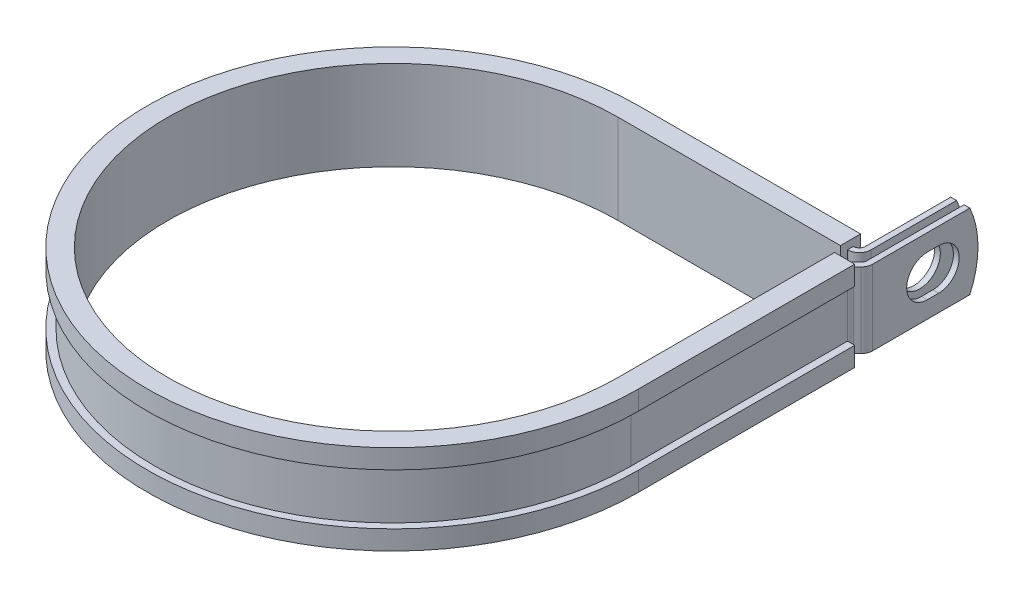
ISO-10303-21;
HEADER;
FILE_DESCRIPTION(('STEP AP214'),'2;1');
FILE_NAME('part.step','',(''),(''),'','','');
FILE_SCHEMA(('AUTOMOTIVE_DESIGN { 1 0 10303 214 1 1 1 1 }'));
ENDSEC;
DATA;
#1=APPLICATION_CONTEXT('core data for automotive mechanical design processes');
#2=APPLICATION_PROTOCOL_DEFINITION('international standard','automotive_design',2000,#1);
#3=PRODUCT_CONTEXT('',#1,'mechanical');
#4=PRODUCT('Part','Part','',(#3));
#5=PRODUCT_RELATED_PRODUCT_CATEGORY('part','',(#4));
#6=PRODUCT_DEFINITION_FORMATION('','',#4);
#7=PRODUCT_DEFINITION_CONTEXT('part definition',#1,'design');
#8=PRODUCT_DEFINITION('design','',#6,#7);
#9=PRODUCT_DEFINITION_SHAPE('','',#8);
#10=(LENGTH_UNIT() NAMED_UNIT(*) SI_UNIT(.MILLI.,.METRE.));
#11=(NAMED_UNIT(*) PLANE_ANGLE_UNIT() SI_UNIT($,.RADIAN.));
#12=(NAMED_UNIT(*) SI_UNIT($,.STERADIAN.) SOLID_ANGLE_UNIT());
#13=UNCERTAINTY_MEASURE_WITH_UNIT(LENGTH_MEASURE(1.E-05),#10,'distance_accuracy_value','');
#14=(GEOMETRIC_REPRESENTATION_CONTEXT(3) GLOBAL_UNCERTAINTY_ASSIGNED_CONTEXT((#13)) GLOBAL_UNIT_ASSIGNED_CONTEXT((#10,
#11,#12)) REPRESENTATION_CONTEXT('',''));
#15=CARTESIAN_POINT('',(0.,0.,0.));
#16=DIRECTION('',(0.,0.,1.));
#17=DIRECTION('',(1.,0.,0.));
#18=AXIS2_PLACEMENT_3D('',#15,#16,#17);
#19=CARTESIAN_POINT('',(49.8272698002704,-7.9375,-49.149));
#20=DIRECTION('',(0.,1.,0.));
#21=DIRECTION('',(1.,0.,0.));
#22=AXIS2_PLACEMENT_3D('',#19,#20,#21);
#23=PLANE('',#22);
#24=DIRECTION('',(0.,0.,-1.));
#25=VECTOR('',#24,1.);
#26=CARTESIAN_POINT('',(46.9824698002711,-7.9375,-49.149));
#27=LINE('',#26,#25);
#28=CARTESIAN_POINT('',(46.9824698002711,-7.9375,-49.149));
#29=VERTEX_POINT('',#28);
#30=CARTESIAN_POINT('',(46.9824698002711,-7.9375,-50.3682));
#31=VERTEX_POINT('',#30);
#32=EDGE_CURVE('E524',#29,#31,#27,.T.);
#33=ORIENTED_EDGE('',*,*,#32,.T.);
#34=DIRECTION('',(1.,0.,0.));
#35=VECTOR('',#34,1.);
#36=CARTESIAN_POINT('',(0.,-7.9375,-50.3682));
#37=LINE('',#36,#35);
#38=CARTESIAN_POINT('',(47.0332698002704,-7.9375,-50.3682));
#39=VERTEX_POINT('',#38);
#40=EDGE_CURVE('E411',#39,#31,#37,.F.);
#41=ORIENTED_EDGE('',*,*,#40,.F.);
#42=CARTESIAN_POINT('',(47.0332698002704,-7.9375,-51.5874));
#43=DIRECTION('',(0.,1.,0.));
#44=DIRECTION('',(1.,0.,0.));
#45=AXIS2_PLACEMENT_3D('',#42,#43,#44);
#46=CIRCLE('',#45,1.2192);
#47=CARTESIAN_POINT('',(48.2524698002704,-7.9375,-51.5874));
#48=VERTEX_POINT('',#47);
#49=EDGE_CURVE('E409',#48,#39,#46,.F.);
#50=ORIENTED_EDGE('',*,*,#49,.F.);
#51=DIRECTION('',(0.,0.,1.));
#52=VECTOR('',#51,1.);
#53=CARTESIAN_POINT('',(48.2524698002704,-7.9375,-71.4248));
#54=LINE('',#53,#52);
#55=CARTESIAN_POINT('',(48.2524698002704,-7.9375,-69.6923804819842));
#56=VERTEX_POINT('',#55);
#57=EDGE_CURVE('E407',#56,#48,#54,.T.);
#58=ORIENTED_EDGE('',*,*,#57,.F.);
#59=DIRECTION('',(-1.,0.,0.));
#60=VECTOR('',#59,1.);
#61=CARTESIAN_POINT('',(52.2656698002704,-7.9375,-69.6923804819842));
#62=LINE('',#61,#60);
#63=CARTESIAN_POINT('',(49.4716698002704,-7.9375,-69.6923804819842));
#64=VERTEX_POINT('',#63);
#65=EDGE_CURVE('E12',#64,#56,#62,.T.);
#66=ORIENTED_EDGE('',*,*,#65,.F.);
#67=DIRECTION('',(0.,0.,1.));
#68=VECTOR('',#67,1.);
#69=CARTESIAN_POINT('',(49.4716698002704,-7.9375,-71.4248));
#70=LINE('',#69,#68);
#71=CARTESIAN_POINT('',(49.4716698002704,-7.9375,-51.5874));
#72=VERTEX_POINT('',#71);
#73=EDGE_CURVE('E405',#64,#72,#70,.T.);
#74=ORIENTED_EDGE('',*,*,#73,.T.);
#75=CARTESIAN_POINT('',(47.0332698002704,-7.9375,-51.5874));
#76=DIRECTION('',(0.,-1.,0.));
#77=DIRECTION('',(0.,0.,1.));
#78=AXIS2_PLACEMENT_3D('',#75,#76,#77);
#79=CIRCLE('',#78,2.4384);
#80=CARTESIAN_POINT('',(47.0332698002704,-7.9375,-49.149));
#81=VERTEX_POINT('',#80);
#82=EDGE_CURVE('E402',#72,#81,#79,.T.);
#83=ORIENTED_EDGE('',*,*,#82,.T.);
#84=DIRECTION('',(-1.,0.,0.));
#85=VECTOR('',#84,1.);
#86=CARTESIAN_POINT('',(0.,-7.9375,-49.149));
#87=LINE('',#86,#85);
#88=EDGE_CURVE('E399',#81,#29,#87,.T.);
#89=ORIENTED_EDGE('',*,*,#88,.T.);
#90=EDGE_LOOP('',(#33,#41,#50,#58,#66,#74,#83,#89));
#91=FACE_BOUND('',#90,.T.);
#92=ADVANCED_FACE('F55',(#91),#23,.F.);
#93=CARTESIAN_POINT('',(49.8272698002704,7.9375,-49.149));
#94=DIRECTION('',(0.,1.,0.));
#95=DIRECTION('',(1.,0.,0.));
#96=AXIS2_PLACEMENT_3D('',#93,#94,#95);
#97=PLANE('',#96);
#98=DIRECTION('',(1.,0.,0.));
#99=VECTOR('',#98,1.);
#100=CARTESIAN_POINT('',(0.,7.9375,-50.3682));
#101=LINE('',#100,#99);
#102=CARTESIAN_POINT('',(47.0332698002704,7.9375,-50.3682));
#103=VERTEX_POINT('',#102);
#104=CARTESIAN_POINT('',(46.9824698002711,7.9375,-50.3682));
#105=VERTEX_POINT('',#104);
#106=EDGE_CURVE('E369',#103,#105,#101,.F.);
#107=ORIENTED_EDGE('',*,*,#106,.T.);
#108=DIRECTION('',(0.,0.,1.));
#109=VECTOR('',#108,1.);
#110=CARTESIAN_POINT('',(46.9824698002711,7.9375,-50.3682));
#111=LINE('',#110,#109);
#112=CARTESIAN_POINT('',(46.9824698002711,7.9375,-49.149));
#113=VERTEX_POINT('',#112);
#114=EDGE_CURVE('E518',#105,#113,#111,.T.);
#115=ORIENTED_EDGE('',*,*,#114,.T.);
#116=DIRECTION('',(-1.,0.,0.));
#117=VECTOR('',#116,1.);
#118=CARTESIAN_POINT('',(0.,7.9375,-49.149));
#119=LINE('',#118,#117);
#120=CARTESIAN_POINT('',(47.0332698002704,7.9375,-49.149));
#121=VERTEX_POINT('',#120);
#122=EDGE_CURVE('E626',#121,#113,#119,.T.);
#123=ORIENTED_EDGE('',*,*,#122,.F.);
#124=CARTESIAN_POINT('',(47.0332698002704,7.9375,-51.5874));
#125=DIRECTION('',(0.,-1.,0.));
#126=DIRECTION('',(0.,0.,1.));
#127=AXIS2_PLACEMENT_3D('',#124,#125,#126);
#128=CIRCLE('',#127,2.4384);
#129=CARTESIAN_POINT('',(49.4716698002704,7.9375,-51.5874));
#130=VERTEX_POINT('',#129);
#131=EDGE_CURVE('E371',#130,#121,#128,.T.);
#132=ORIENTED_EDGE('',*,*,#131,.F.);
#133=DIRECTION('',(0.,0.,1.));
#134=VECTOR('',#133,1.);
#135=CARTESIAN_POINT('',(49.4716698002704,7.9375,-71.4248));
#136=LINE('',#135,#134);
#137=CARTESIAN_POINT('',(49.4716698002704,7.9375,-69.6923804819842));
#138=VERTEX_POINT('',#137);
#139=EDGE_CURVE('E362',#138,#130,#136,.T.);
#140=ORIENTED_EDGE('',*,*,#139,.F.);
#141=DIRECTION('',(-1.,0.,0.));
#142=VECTOR('',#141,1.);
#143=CARTESIAN_POINT('',(52.2656698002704,7.9375,-69.6923804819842));
#144=LINE('',#143,#142);
#145=CARTESIAN_POINT('',(48.2524698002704,7.9375,-69.6923804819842));
#146=VERTEX_POINT('',#145);
#147=EDGE_CURVE('E63',#138,#146,#144,.T.);
#148=ORIENTED_EDGE('',*,*,#147,.T.);
#149=DIRECTION('',(0.,0.,1.));
#150=VECTOR('',#149,1.);
#151=CARTESIAN_POINT('',(48.2524698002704,7.9375,-71.4248));
#152=LINE('',#151,#150);
#153=CARTESIAN_POINT('',(48.2524698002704,7.9375,-51.5874));
#154=VERTEX_POINT('',#153);
#155=EDGE_CURVE('E359',#146,#154,#152,.T.);
#156=ORIENTED_EDGE('',*,*,#155,.T.);
#157=CARTESIAN_POINT('',(47.0332698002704,7.9375,-51.5874));
#158=DIRECTION('',(0.,1.,0.));
#159=DIRECTION('',(1.,0.,0.));
#160=AXIS2_PLACEMENT_3D('',#157,#158,#159);
#161=CIRCLE('',#160,1.2192);
#162=EDGE_CURVE('E367',#154,#103,#161,.F.);
#163=ORIENTED_EDGE('',*,*,#162,.T.);
#164=EDGE_LOOP('',(#107,#115,#123,#132,#140,#148,#156,#163));
#165=FACE_BOUND('',#164,.T.);
#166=ADVANCED_FACE('F358',(#165),#97,.T.);
#167=CARTESIAN_POINT('',(0.,7.9375,-49.149));
#168=DIRECTION('',(0.,0.,1.));
#169=DIRECTION('',(1.,0.,0.));
#170=AXIS2_PLACEMENT_3D('',#167,#168,#169);
#171=PLANE('',#170);
#172=ORIENTED_EDGE('',*,*,#122,.T.);
#173=DIRECTION('',(0.,-1.,0.));
#174=VECTOR('',#173,1.);
#175=CARTESIAN_POINT('',(46.9824698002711,7.9375,-49.149));
#176=LINE('',#175,#174);
#177=EDGE_CURVE('E521',#113,#29,#176,.T.);
#178=ORIENTED_EDGE('',*,*,#177,.T.);
#179=ORIENTED_EDGE('',*,*,#88,.F.);
#180=DIRECTION('',(0.,-1.,0.));
#181=VECTOR('',#180,1.);
#182=CARTESIAN_POINT('',(47.0332698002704,7.9375,-49.149));
#183=LINE('',#182,#181);
#184=EDGE_CURVE('E345',#121,#81,#183,.T.);
#185=ORIENTED_EDGE('',*,*,#184,.F.);
#186=EDGE_LOOP('',(#172,#178,#179,#185));
#187=FACE_BOUND('',#186,.T.);
#188=ADVANCED_FACE('F636',(#187),#171,.T.);
#189=CARTESIAN_POINT('',(52.2656698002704,7.9375,-49.149));
#190=DIRECTION('',(-1.,0.,0.));
#191=DIRECTION('',(0.,0.,1.));
#192=AXIS2_PLACEMENT_3D('',#189,#190,#191);
#193=PLANE('',#192);
#194=CARTESIAN_POINT('',(52.2656698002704,0.,-63.0935999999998));
#195=DIRECTION('',(1.,0.,0.));
#196=DIRECTION('',(0.,0.,-1.));
#197=AXIS2_PLACEMENT_3D('',#194,#195,#196);
#198=CIRCLE('',#197,4.3561);
#199=CARTESIAN_POINT('',(52.2656698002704,-4.3561,-63.0936000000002));
#200=VERTEX_POINT('',#199);
#201=CARTESIAN_POINT('',(52.2656698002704,4.3561,-63.0936000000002));
#202=VERTEX_POINT('',#201);
#203=EDGE_CURVE('E581',#200,#202,#198,.T.);
#204=ORIENTED_EDGE('',*,*,#203,.F.);
#205=DIRECTION('',(0.,0.,-1.));
#206=VECTOR('',#205,1.);
#207=CARTESIAN_POINT('',(52.2656698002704,-4.3561,-60.7059999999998));
#208=LINE('',#207,#206);
#209=CARTESIAN_POINT('',(52.2656698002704,-4.3561,-60.7059999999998));
#210=VERTEX_POINT('',#209);
#211=EDGE_CURVE('E584',#210,#200,#208,.T.);
#212=ORIENTED_EDGE('',*,*,#211,.F.);
#213=CARTESIAN_POINT('',(52.2656698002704,0.,-60.7059999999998));
#214=DIRECTION('',(1.,0.,0.));
#215=DIRECTION('',(0.,0.,-1.));
#216=AXIS2_PLACEMENT_3D('',#213,#214,#215);
#217=CIRCLE('',#216,4.3561);
#218=CARTESIAN_POINT('',(52.2656698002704,4.3561,-60.7059999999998));
#219=VERTEX_POINT('',#218);
#220=EDGE_CURVE('E577',#219,#210,#217,.T.);
#221=ORIENTED_EDGE('',*,*,#220,.F.);
#222=DIRECTION('',(0.,0.,1.));
#223=VECTOR('',#222,1.);
#224=CARTESIAN_POINT('',(52.2656698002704,4.3561,-60.7059999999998));
#225=LINE('',#224,#223);
#226=EDGE_CURVE('E578',#202,#219,#225,.T.);
#227=ORIENTED_EDGE('',*,*,#226,.F.);
#228=EDGE_LOOP('',(#204,#212,#221,#227));
#229=FACE_BOUND('',#228,.T.);
#230=DIRECTION('',(0.,0.,-1.));
#231=VECTOR('',#230,1.);
#232=CARTESIAN_POINT('',(52.2656698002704,-7.9375,-49.149));
#233=LINE('',#232,#231);
#234=CARTESIAN_POINT('',(52.2656698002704,-7.9375,-49.149));
#235=VERTEX_POINT('',#234);
#236=CARTESIAN_POINT('',(52.2656698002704,-7.9375,-69.6923804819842));
#237=VERTEX_POINT('',#236);
#238=EDGE_CURVE('E383',#235,#237,#233,.T.);
#239=ORIENTED_EDGE('',*,*,#238,.T.);
#240=CARTESIAN_POINT('',(52.2656698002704,0.,-52.3748));
#241=DIRECTION('',(-1.,0.,0.));
#242=DIRECTION('',(0.,0.,1.));
#243=AXIS2_PLACEMENT_3D('',#240,#241,#242);
#244=CIRCLE('',#243,19.05);
#245=CARTESIAN_POINT('',(52.2656698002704,7.9375,-69.6923804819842));
#246=VERTEX_POINT('',#245);
#247=EDGE_CURVE('E569',#246,#237,#244,.T.);
#248=ORIENTED_EDGE('',*,*,#247,.F.);
#249=DIRECTION('',(0.,0.,-1.));
#250=VECTOR('',#249,1.);
#251=CARTESIAN_POINT('',(52.2656698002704,7.9375,-49.149));
#252=LINE('',#251,#250);
#253=CARTESIAN_POINT('',(52.2656698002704,7.9375,-49.149));
#254=VERTEX_POINT('',#253);
#255=EDGE_CURVE('E420',#254,#246,#252,.T.);
#256=ORIENTED_EDGE('',*,*,#255,.F.);
#257=DIRECTION('',(0.,-1.,0.));
#258=VECTOR('',#257,1.);
#259=CARTESIAN_POINT('',(52.2656698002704,7.9375,-49.149));
#260=LINE('',#259,#258);
#261=EDGE_CURVE('E382',#254,#235,#260,.T.);
#262=ORIENTED_EDGE('',*,*,#261,.T.);
#263=EDGE_LOOP('',(#239,#248,#256,#262));
#264=FACE_BOUND('',#263,.T.);
#265=ADVANCED_FACE('F57',(#229,#264),#193,.F.);
#266=CARTESIAN_POINT('',(51.0464698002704,7.9375,-49.149));
#267=DIRECTION('',(-1.,0.,0.));
#268=DIRECTION('',(0.,0.,1.));
#269=AXIS2_PLACEMENT_3D('',#266,#267,#268);
#270=PLANE('',#269);
#271=DIRECTION('',(0.,0.,-1.));
#272=VECTOR('',#271,1.);
#273=CARTESIAN_POINT('',(51.0464698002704,-4.3561,-60.7059999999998));
#274=LINE('',#273,#272);
#275=CARTESIAN_POINT('',(51.0464698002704,-4.3561,-60.7059999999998));
#276=VERTEX_POINT('',#275);
#277=CARTESIAN_POINT('',(51.0464698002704,-4.3561,-63.0936000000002));
#278=VERTEX_POINT('',#277);
#279=EDGE_CURVE('E580',#276,#278,#274,.T.);
#280=ORIENTED_EDGE('',*,*,#279,.T.);
#281=CARTESIAN_POINT('',(51.0464698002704,0.,-63.0935999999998));
#282=DIRECTION('',(-1.,0.,0.));
#283=DIRECTION('',(0.,0.,1.));
#284=AXIS2_PLACEMENT_3D('',#281,#282,#283);
#285=CIRCLE('',#284,4.3561);
#286=CARTESIAN_POINT('',(51.0464698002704,4.3561,-63.0936000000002));
#287=VERTEX_POINT('',#286);
#288=EDGE_CURVE('E601',#278,#287,#285,.F.);
#289=ORIENTED_EDGE('',*,*,#288,.T.);
#290=DIRECTION('',(0.,0.,1.));
#291=VECTOR('',#290,1.);
#292=CARTESIAN_POINT('',(51.0464698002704,4.3561,-60.7059999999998));
#293=LINE('',#292,#291);
#294=CARTESIAN_POINT('',(51.0464698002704,4.3561,-60.7059999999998));
#295=VERTEX_POINT('',#294);
#296=EDGE_CURVE('E597',#287,#295,#293,.T.);
#297=ORIENTED_EDGE('',*,*,#296,.T.);
#298=CARTESIAN_POINT('',(51.0464698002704,0.,-60.7059999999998));
#299=DIRECTION('',(-1.,0.,0.));
#300=DIRECTION('',(0.,0.,1.));
#301=AXIS2_PLACEMENT_3D('',#298,#299,#300);
#302=CIRCLE('',#301,4.3561);
#303=EDGE_CURVE('E592',#295,#276,#302,.F.);
#304=ORIENTED_EDGE('',*,*,#303,.T.);
#305=EDGE_LOOP('',(#280,#289,#297,#304));
#306=FACE_BOUND('',#305,.T.);
#307=CARTESIAN_POINT('',(51.0464698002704,0.,-52.3748));
#308=DIRECTION('',(-1.,0.,0.));
#309=DIRECTION('',(0.,0.,1.));
#310=AXIS2_PLACEMENT_3D('',#307,#308,#309);
#311=CIRCLE('',#310,19.05);
#312=CARTESIAN_POINT('',(51.0464698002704,7.9375,-69.6923804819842));
#313=VERTEX_POINT('',#312);
#314=CARTESIAN_POINT('',(51.0464698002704,-7.9375,-69.6923804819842));
#315=VERTEX_POINT('',#314);
#316=EDGE_CURVE('E77',#313,#315,#311,.T.);
#317=ORIENTED_EDGE('',*,*,#316,.T.);
#318=DIRECTION('',(0.,0.,-1.));
#319=VECTOR('',#318,1.);
#320=CARTESIAN_POINT('',(51.0464698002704,-7.9375,-49.149));
#321=LINE('',#320,#319);
#322=CARTESIAN_POINT('',(51.0464698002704,-7.9375,-49.149));
#323=VERTEX_POINT('',#322);
#324=EDGE_CURVE('E386',#323,#315,#321,.T.);
#325=ORIENTED_EDGE('',*,*,#324,.F.);
#326=DIRECTION('',(0.,-1.,0.));
#327=VECTOR('',#326,1.);
#328=CARTESIAN_POINT('',(51.0464698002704,7.9375,-49.149));
#329=LINE('',#328,#327);
#330=CARTESIAN_POINT('',(51.0464698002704,7.9375,-49.149));
#331=VERTEX_POINT('',#330);
#332=EDGE_CURVE('E353',#331,#323,#329,.T.);
#333=ORIENTED_EDGE('',*,*,#332,.F.);
#334=DIRECTION('',(0.,0.,-1.));
#335=VECTOR('',#334,1.);
#336=CARTESIAN_POINT('',(51.0464698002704,7.9375,-49.149));
#337=LINE('',#336,#335);
#338=EDGE_CURVE('E616',#331,#313,#337,.T.);
#339=ORIENTED_EDGE('',*,*,#338,.T.);
#340=EDGE_LOOP('',(#317,#325,#333,#339));
#341=FACE_BOUND('',#340,.T.);
#342=ADVANCED_FACE('F690',(#306,#341),#270,.T.);
#343=CARTESIAN_POINT('',(49.4716698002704,7.9375,-71.4248));
#344=DIRECTION('',(1.,0.,0.));
#345=DIRECTION('',(0.,0.,-1.));
#346=AXIS2_PLACEMENT_3D('',#343,#344,#345);
#347=PLANE('',#346);
#348=CARTESIAN_POINT('',(49.4716698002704,0.,-61.8998));
#349=DIRECTION('',(1.,0.,0.));
#350=DIRECTION('',(0.,0.,-1.));
#351=AXIS2_PLACEMENT_3D('',#348,#349,#350);
#352=CIRCLE('',#351,4.3561);
#353=CARTESIAN_POINT('',(49.4716698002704,0.,-66.2559));
#354=VERTEX_POINT('',#353);
#355=EDGE_CURVE('E387',#354,#354,#352,.F.);
#356=ORIENTED_EDGE('',*,*,#355,.T.);
#357=EDGE_LOOP('',(#356));
#358=FACE_BOUND('',#357,.T.);
#359=ORIENTED_EDGE('',*,*,#73,.F.);
#360=CARTESIAN_POINT('',(49.4716698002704,0.,-52.3748));
#361=DIRECTION('',(1.,0.,0.));
#362=DIRECTION('',(0.,0.,-1.));
#363=AXIS2_PLACEMENT_3D('',#360,#361,#362);
#364=CIRCLE('',#363,19.05);
#365=EDGE_CURVE('E574',#64,#138,#364,.T.);
#366=ORIENTED_EDGE('',*,*,#365,.T.);
#367=ORIENTED_EDGE('',*,*,#139,.T.);
#368=DIRECTION('',(0.,-1.,0.));
#369=VECTOR('',#368,1.);
#370=CARTESIAN_POINT('',(49.4716698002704,7.9375,-51.5874));
#371=LINE('',#370,#369);
#372=EDGE_CURVE('E342',#130,#72,#371,.T.);
#373=ORIENTED_EDGE('',*,*,#372,.T.);
#374=EDGE_LOOP('',(#359,#366,#367,#373));
#375=FACE_BOUND('',#374,.T.);
#376=ADVANCED_FACE('F642',(#358,#375),#347,.T.);
#377=CARTESIAN_POINT('',(48.2524698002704,7.9375,-71.4248));
#378=DIRECTION('',(1.,0.,0.));
#379=DIRECTION('',(0.,0.,-1.));
#380=AXIS2_PLACEMENT_3D('',#377,#378,#379);
#381=PLANE('',#380);
#382=CARTESIAN_POINT('',(48.2524698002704,0.,-61.8998));
#383=DIRECTION('',(-1.,0.,0.));
#384=DIRECTION('',(0.,0.,1.));
#385=AXIS2_PLACEMENT_3D('',#382,#383,#384);
#386=CIRCLE('',#385,4.3561);
#387=CARTESIAN_POINT('',(48.2524698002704,0.,-57.5437));
#388=VERTEX_POINT('',#387);
#389=EDGE_CURVE('E609',#388,#388,#386,.T.);
#390=ORIENTED_EDGE('',*,*,#389,.F.);
#391=EDGE_LOOP('',(#390));
#392=FACE_BOUND('',#391,.T.);
#393=CARTESIAN_POINT('',(48.2524698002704,0.,-52.3748));
#394=DIRECTION('',(-1.,0.,0.));
#395=DIRECTION('',(0.,0.,1.));
#396=AXIS2_PLACEMENT_3D('',#393,#394,#395);
#397=CIRCLE('',#396,19.05);
#398=EDGE_CURVE('E69',#146,#56,#397,.T.);
#399=ORIENTED_EDGE('',*,*,#398,.T.);
#400=ORIENTED_EDGE('',*,*,#57,.T.);
#401=DIRECTION('',(0.,-1.,0.));
#402=VECTOR('',#401,1.);
#403=CARTESIAN_POINT('',(48.2524698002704,7.9375,-51.5874));
#404=LINE('',#403,#402);
#405=EDGE_CURVE('E339',#154,#48,#404,.T.);
#406=ORIENTED_EDGE('',*,*,#405,.F.);
#407=ORIENTED_EDGE('',*,*,#155,.F.);
#408=EDGE_LOOP('',(#399,#400,#406,#407));
#409=FACE_BOUND('',#408,.T.);
#410=ADVANCED_FACE('F365',(#392,#409),#381,.F.);
#411=CARTESIAN_POINT('',(51.5874,-7.9375,-45.7365026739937));
#412=DIRECTION('',(0.,1.,0.));
#413=DIRECTION('',(1.,0.,0.));
#414=AXIS2_PLACEMENT_3D('',#411,#412,#413);
#415=CIRCLE('',#414,1.2192);
#416=CARTESIAN_POINT('',(50.3682,-7.9375,-45.7365026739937));
#417=VERTEX_POINT('',#416);
#418=CARTESIAN_POINT('',(50.7252954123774,-7.9375,-46.5986072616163));
#419=VERTEX_POINT('',#418);
#420=EDGE_CURVE('E414',#417,#419,#415,.F.);
#421=ORIENTED_EDGE('',*,*,#420,.F.);
#422=DIRECTION('',(1.,0.,0.));
#423=VECTOR('',#422,1.);
#424=CARTESIAN_POINT('',(49.149,-7.9375,-45.7365026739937));
#425=LINE('',#424,#423);
#426=CARTESIAN_POINT('',(49.149,-7.9375,-45.7365026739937));
#427=VERTEX_POINT('',#426);
#428=EDGE_CURVE('E452',#427,#417,#425,.T.);
#429=ORIENTED_EDGE('',*,*,#428,.F.);
#430=CARTESIAN_POINT('',(51.5874,-7.9375,-45.7365026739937));
#431=DIRECTION('',(0.,-1.,0.));
#432=DIRECTION('',(0.,0.,1.));
#433=AXIS2_PLACEMENT_3D('',#430,#431,#432);
#434=CIRCLE('',#433,2.4384);
#435=CARTESIAN_POINT('',(49.8631908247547,-7.9375,-47.460711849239));
#436=VERTEX_POINT('',#435);
#437=EDGE_CURVE('E396',#427,#436,#434,.T.);
#438=ORIENTED_EDGE('',*,*,#437,.T.);
#439=DIRECTION('',(0.707106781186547,0.,-0.707106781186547));
#440=VECTOR('',#439,1.);
#441=CARTESIAN_POINT('',(49.8631908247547,-7.9375,-47.460711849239));
#442=LINE('',#441,#440);
#443=CARTESIAN_POINT('',(50.6893743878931,-7.9375,-48.2868954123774));
#444=VERTEX_POINT('',#443);
#445=EDGE_CURVE('E393',#436,#444,#442,.T.);
#446=ORIENTED_EDGE('',*,*,#445,.T.);
#447=CARTESIAN_POINT('',(49.8272698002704,-7.9375,-49.149));
#448=DIRECTION('',(0.,1.,0.));
#449=DIRECTION('',(0.,0.,1.));
#450=AXIS2_PLACEMENT_3D('',#447,#448,#449);
#451=CIRCLE('',#450,1.21920000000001);
#452=EDGE_CURVE('E390',#444,#323,#451,.T.);
#453=ORIENTED_EDGE('',*,*,#452,.T.);
#454=ORIENTED_EDGE('',*,*,#324,.T.);
#455=DIRECTION('',(-1.,0.,0.));
#456=VECTOR('',#455,1.);
#457=CARTESIAN_POINT('',(52.2656698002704,-7.9375,-69.6923804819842));
#458=LINE('',#457,#456);
#459=EDGE_CURVE('E567',#237,#315,#458,.T.);
#460=ORIENTED_EDGE('',*,*,#459,.F.);
#461=ORIENTED_EDGE('',*,*,#238,.F.);
#462=CARTESIAN_POINT('',(49.8272698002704,-7.9375,-49.149));
#463=DIRECTION('',(0.,1.,0.));
#464=DIRECTION('',(1.,0.,0.));
#465=AXIS2_PLACEMENT_3D('',#462,#463,#464);
#466=CIRCLE('',#465,2.43840000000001);
#467=CARTESIAN_POINT('',(51.5514789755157,-7.9375,-47.4247908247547));
#468=VERTEX_POINT('',#467);
#469=EDGE_CURVE('E418',#468,#235,#466,.T.);
#470=ORIENTED_EDGE('',*,*,#469,.F.);
#471=DIRECTION('',(0.707106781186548,0.,-0.707106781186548));
#472=VECTOR('',#471,1.);
#473=CARTESIAN_POINT('',(50.7252954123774,-7.9375,-46.5986072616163));
#474=LINE('',#473,#472);
#475=EDGE_CURVE('E416',#419,#468,#474,.T.);
#476=ORIENTED_EDGE('',*,*,#475,.F.);
#477=EDGE_LOOP('',(#421,#429,#438,#446,#453,#454,#460,#461,#470,#476));
#478=FACE_BOUND('',#477,.T.);
#479=ADVANCED_FACE('F676',(#478),#23,.F.);
#480=DIRECTION('',(-1.,0.,0.));
#481=VECTOR('',#480,1.);
#482=CARTESIAN_POINT('',(50.3682,7.9375,-45.7365026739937));
#483=LINE('',#482,#481);
#484=CARTESIAN_POINT('',(50.3682,7.9375,-45.7365026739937));
#485=VERTEX_POINT('',#484);
#486=CARTESIAN_POINT('',(49.149,7.9375,-45.7365026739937));
#487=VERTEX_POINT('',#486);
#488=EDGE_CURVE('E441',#485,#487,#483,.T.);
#489=ORIENTED_EDGE('',*,*,#488,.F.);
#490=CARTESIAN_POINT('',(51.5874,7.9375,-45.7365026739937));
#491=DIRECTION('',(0.,1.,0.));
#492=DIRECTION('',(1.,0.,0.));
#493=AXIS2_PLACEMENT_3D('',#490,#491,#492);
#494=CIRCLE('',#493,1.2192);
#495=CARTESIAN_POINT('',(50.7252954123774,7.9375,-46.5986072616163));
#496=VERTEX_POINT('',#495);
#497=EDGE_CURVE('E376',#485,#496,#494,.F.);
#498=ORIENTED_EDGE('',*,*,#497,.T.);
#499=DIRECTION('',(0.707106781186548,0.,-0.707106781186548));
#500=VECTOR('',#499,1.);
#501=CARTESIAN_POINT('',(50.7252954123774,7.9375,-46.5986072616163));
#502=LINE('',#501,#500);
#503=CARTESIAN_POINT('',(51.5514789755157,7.9375,-47.4247908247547));
#504=VERTEX_POINT('',#503);
#505=EDGE_CURVE('E378',#496,#504,#502,.T.);
#506=ORIENTED_EDGE('',*,*,#505,.T.);
#507=CARTESIAN_POINT('',(49.8272698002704,7.9375,-49.149));
#508=DIRECTION('',(0.,1.,0.));
#509=DIRECTION('',(1.,0.,0.));
#510=AXIS2_PLACEMENT_3D('',#507,#508,#509);
#511=CIRCLE('',#510,2.43840000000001);
#512=EDGE_CURVE('E380',#504,#254,#511,.T.);
#513=ORIENTED_EDGE('',*,*,#512,.T.);
#514=ORIENTED_EDGE('',*,*,#255,.T.);
#515=DIRECTION('',(-1.,0.,0.));
#516=VECTOR('',#515,1.);
#517=CARTESIAN_POINT('',(52.2656698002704,7.9375,-69.6923804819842));
#518=LINE('',#517,#516);
#519=EDGE_CURVE('E571',#246,#313,#518,.T.);
#520=ORIENTED_EDGE('',*,*,#519,.T.);
#521=ORIENTED_EDGE('',*,*,#338,.F.);
#522=CARTESIAN_POINT('',(49.8272698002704,7.9375,-49.149));
#523=DIRECTION('',(0.,1.,0.));
#524=DIRECTION('',(0.,0.,1.));
#525=AXIS2_PLACEMENT_3D('',#522,#523,#524);
#526=CIRCLE('',#525,1.21920000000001);
#527=CARTESIAN_POINT('',(50.6893743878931,7.9375,-48.2868954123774));
#528=VERTEX_POINT('',#527);
#529=EDGE_CURVE('E619',#528,#331,#526,.T.);
#530=ORIENTED_EDGE('',*,*,#529,.F.);
#531=DIRECTION('',(0.707106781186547,0.,-0.707106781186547));
#532=VECTOR('',#531,1.);
#533=CARTESIAN_POINT('',(49.8631908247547,7.9375,-47.460711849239));
#534=LINE('',#533,#532);
#535=CARTESIAN_POINT('',(49.8631908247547,7.9375,-47.460711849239));
#536=VERTEX_POINT('',#535);
#537=EDGE_CURVE('E622',#536,#528,#534,.T.);
#538=ORIENTED_EDGE('',*,*,#537,.F.);
#539=CARTESIAN_POINT('',(51.5874,7.9375,-45.7365026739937));
#540=DIRECTION('',(0.,-1.,0.));
#541=DIRECTION('',(0.,0.,1.));
#542=AXIS2_PLACEMENT_3D('',#539,#540,#541);
#543=CIRCLE('',#542,2.4384);
#544=EDGE_CURVE('E451',#487,#536,#543,.T.);
#545=ORIENTED_EDGE('',*,*,#544,.F.);
#546=EDGE_LOOP('',(#489,#498,#506,#513,#514,#520,#521,#530,#538,#545));
#547=FACE_BOUND('',#546,.T.);
#548=ADVANCED_FACE('F448',(#547),#97,.T.);
#549=CARTESIAN_POINT('',(49.8272698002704,7.9375,-49.149));
#550=DIRECTION('',(0.,-1.,0.));
#551=DIRECTION('',(0.,0.,-1.));
#552=AXIS2_PLACEMENT_3D('',#549,#550,#551);
#553=CYLINDRICAL_SURFACE('',#552,1.21920000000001);
#554=ORIENTED_EDGE('',*,*,#452,.F.);
#555=DIRECTION('',(0.,-1.,0.));
#556=VECTOR('',#555,1.);
#557=CARTESIAN_POINT('',(50.6893743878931,7.9375,-48.2868954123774));
#558=LINE('',#557,#556);
#559=EDGE_CURVE('E351',#528,#444,#558,.T.);
#560=ORIENTED_EDGE('',*,*,#559,.F.);
#561=ORIENTED_EDGE('',*,*,#529,.T.);
#562=ORIENTED_EDGE('',*,*,#332,.T.);
#563=EDGE_LOOP('',(#554,#560,#561,#562));
#564=FACE_BOUND('',#563,.T.);
#565=ADVANCED_FACE('F686',(#564),#553,.F.);
#566=CARTESIAN_POINT('',(49.8631908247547,7.9375,-47.460711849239));
#567=DIRECTION('',(-0.707106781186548,0.,-0.707106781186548));
#568=DIRECTION('',(-0.707106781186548,0.,0.707106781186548));
#569=AXIS2_PLACEMENT_3D('',#566,#567,#568);
#570=PLANE('',#569);
#571=ORIENTED_EDGE('',*,*,#445,.F.);
#572=DIRECTION('',(0.,-1.,0.));
#573=VECTOR('',#572,1.);
#574=CARTESIAN_POINT('',(49.8631908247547,7.9375,-47.460711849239));
#575=LINE('',#574,#573);
#576=EDGE_CURVE('E349',#536,#436,#575,.T.);
#577=ORIENTED_EDGE('',*,*,#576,.F.);
#578=ORIENTED_EDGE('',*,*,#537,.T.);
#579=ORIENTED_EDGE('',*,*,#559,.T.);
#580=EDGE_LOOP('',(#571,#577,#578,#579));
#581=FACE_BOUND('',#580,.T.);
#582=ADVANCED_FACE('F681',(#581),#570,.T.);
#583=CARTESIAN_POINT('',(51.5874,7.9375,-45.7365026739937));
#584=DIRECTION('',(0.,-1.,0.));
#585=DIRECTION('',(0.,0.,-1.));
#586=AXIS2_PLACEMENT_3D('',#583,#584,#585);
#587=CYLINDRICAL_SURFACE('',#586,2.4384);
#588=ORIENTED_EDGE('',*,*,#437,.F.);
#589=DIRECTION('',(0.,-1.,0.));
#590=VECTOR('',#589,1.);
#591=CARTESIAN_POINT('',(49.149,7.9375,-45.7365026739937));
#592=LINE('',#591,#590);
#593=EDGE_CURVE('E347',#487,#427,#592,.T.);
#594=ORIENTED_EDGE('',*,*,#593,.F.);
#595=ORIENTED_EDGE('',*,*,#544,.T.);
#596=ORIENTED_EDGE('',*,*,#576,.T.);
#597=EDGE_LOOP('',(#588,#594,#595,#596));
#598=FACE_BOUND('',#597,.T.);
#599=ADVANCED_FACE('F678',(#598),#587,.T.);
#600=CARTESIAN_POINT('',(47.0332698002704,7.9375,-51.5874));
#601=DIRECTION('',(0.,-1.,0.));
#602=DIRECTION('',(0.,0.,-1.));
#603=AXIS2_PLACEMENT_3D('',#600,#601,#602);
#604=CYLINDRICAL_SURFACE('',#603,2.4384);
#605=ORIENTED_EDGE('',*,*,#82,.F.);
#606=ORIENTED_EDGE('',*,*,#372,.F.);
#607=ORIENTED_EDGE('',*,*,#131,.T.);
#608=ORIENTED_EDGE('',*,*,#184,.T.);
#609=EDGE_LOOP('',(#605,#606,#607,#608));
#610=FACE_BOUND('',#609,.T.);
#611=ADVANCED_FACE('F632',(#610),#604,.T.);
#612=CARTESIAN_POINT('',(47.0332698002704,7.9375,-51.5874));
#613=DIRECTION('',(0.,-1.,0.));
#614=DIRECTION('',(0.,0.,-1.));
#615=AXIS2_PLACEMENT_3D('',#612,#613,#614);
#616=CYLINDRICAL_SURFACE('',#615,1.2192);
#617=ORIENTED_EDGE('',*,*,#49,.T.);
#618=DIRECTION('',(0.,-1.,0.));
#619=VECTOR('',#618,1.);
#620=CARTESIAN_POINT('',(47.0332698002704,7.9375,-50.3682));
#621=LINE('',#620,#619);
#622=EDGE_CURVE('E330',#103,#39,#621,.T.);
#623=ORIENTED_EDGE('',*,*,#622,.F.);
#624=ORIENTED_EDGE('',*,*,#162,.F.);
#625=ORIENTED_EDGE('',*,*,#405,.T.);
#626=EDGE_LOOP('',(#617,#623,#624,#625));
#627=FACE_BOUND('',#626,.T.);
#628=ADVANCED_FACE('F647',(#627),#616,.F.);
#629=CARTESIAN_POINT('',(0.,7.9375,-50.3682));
#630=DIRECTION('',(0.,0.,1.));
#631=DIRECTION('',(1.,0.,0.));
#632=AXIS2_PLACEMENT_3D('',#629,#630,#631);
#633=PLANE('',#632);
#634=DIRECTION('',(0.,-1.,0.));
#635=VECTOR('',#634,1.);
#636=CARTESIAN_POINT('',(0.,7.9375,-50.3682));
#637=LINE('',#636,#635);
#638=CARTESIAN_POINT('',(7.06522684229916E-13,5.3975,-50.3682));
#639=VERTEX_POINT('',#638);
#640=CARTESIAN_POINT('',(7.06522684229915E-13,-5.3975,-50.3682));
#641=VERTEX_POINT('',#640);
#642=EDGE_CURVE('E321',#639,#641,#637,.T.);
#643=ORIENTED_EDGE('',*,*,#642,.F.);
#644=DIRECTION('',(1.,0.,0.));
#645=VECTOR('',#644,1.);
#646=CARTESIAN_POINT('',(7.06522684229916E-13,5.3975,-50.3682));
#647=LINE('',#646,#645);
#648=CARTESIAN_POINT('',(46.9824698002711,5.3975,-50.3682));
#649=VERTEX_POINT('',#648);
#650=EDGE_CURVE('E564',#639,#649,#647,.T.);
#651=ORIENTED_EDGE('',*,*,#650,.T.);
#652=DIRECTION('',(0.,1.,0.));
#653=VECTOR('',#652,1.);
#654=CARTESIAN_POINT('',(46.9824698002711,7.9375,-50.3682));
#655=LINE('',#654,#653);
#656=EDGE_CURVE('E515',#649,#105,#655,.T.);
#657=ORIENTED_EDGE('',*,*,#656,.T.);
#658=ORIENTED_EDGE('',*,*,#106,.F.);
#659=ORIENTED_EDGE('',*,*,#622,.T.);
#660=ORIENTED_EDGE('',*,*,#40,.T.);
#661=DIRECTION('',(0.,1.,0.));
#662=VECTOR('',#661,1.);
#663=CARTESIAN_POINT('',(46.9824698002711,-7.9375,-50.3682));
#664=LINE('',#663,#662);
#665=CARTESIAN_POINT('',(46.9824698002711,-5.3975,-50.3682));
#666=VERTEX_POINT('',#665);
#667=EDGE_CURVE('E527',#31,#666,#664,.T.);
#668=ORIENTED_EDGE('',*,*,#667,.T.);
#669=DIRECTION('',(1.,0.,0.));
#670=VECTOR('',#669,1.);
#671=CARTESIAN_POINT('',(7.06522684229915E-13,-5.3975,-50.3682));
#672=LINE('',#671,#670);
#673=EDGE_CURVE('E544',#641,#666,#672,.T.);
#674=ORIENTED_EDGE('',*,*,#673,.F.);
#675=EDGE_LOOP('',(#643,#651,#657,#658,#659,#660,#668,#674));
#676=FACE_BOUND('',#675,.T.);
#677=ADVANCED_FACE('F651',(#676),#633,.F.);
#678=CARTESIAN_POINT('',(0.,7.9375,0.));
#679=DIRECTION('',(0.,-1.,0.));
#680=DIRECTION('',(0.,0.,-1.));
#681=AXIS2_PLACEMENT_3D('',#678,#679,#680);
#682=CYLINDRICAL_SURFACE('',#681,50.3682);
#683=DIRECTION('',(0.,-1.,0.));
#684=VECTOR('',#683,1.);
#685=CARTESIAN_POINT('',(50.3682,7.9375,0.));
#686=LINE('',#685,#684);
#687=CARTESIAN_POINT('',(50.3682,5.3975,0.));
#688=VERTEX_POINT('',#687);
#689=CARTESIAN_POINT('',(50.3682,-5.3975,0.));
#690=VERTEX_POINT('',#689);
#691=EDGE_CURVE('E319',#688,#690,#686,.T.);
#692=ORIENTED_EDGE('',*,*,#691,.F.);
#693=CARTESIAN_POINT('',(0.,5.3975,0.));
#694=DIRECTION('',(0.,-1.,0.));
#695=DIRECTION('',(0.,0.,-1.));
#696=AXIS2_PLACEMENT_3D('',#693,#694,#695);
#697=CIRCLE('',#696,50.3682);
#698=EDGE_CURVE('E513',#688,#639,#697,.T.);
#699=ORIENTED_EDGE('',*,*,#698,.T.);
#700=ORIENTED_EDGE('',*,*,#642,.T.);
#701=CARTESIAN_POINT('',(0.,-5.3975,0.));
#702=DIRECTION('',(0.,-1.,0.));
#703=DIRECTION('',(0.,0.,-1.));
#704=AXIS2_PLACEMENT_3D('',#701,#702,#703);
#705=CIRCLE('',#704,50.3682);
#706=EDGE_CURVE('E302',#690,#641,#705,.T.);
#707=ORIENTED_EDGE('',*,*,#706,.F.);
#708=EDGE_LOOP('',(#692,#699,#700,#707));
#709=FACE_BOUND('',#708,.T.);
#710=ADVANCED_FACE('F317',(#709),#682,.T.);
#711=CARTESIAN_POINT('',(50.3682,7.9375,0.));
#712=DIRECTION('',(-1.,0.,0.));
#713=DIRECTION('',(0.,0.,1.));
#714=AXIS2_PLACEMENT_3D('',#711,#712,#713);
#715=PLANE('',#714);
#716=DIRECTION('',(0.,-1.,0.));
#717=VECTOR('',#716,1.);
#718=CARTESIAN_POINT('',(50.3682,7.9375,-45.7365026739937));
#719=LINE('',#718,#717);
#720=CARTESIAN_POINT('',(50.3682,5.3975,-45.7365026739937));
#721=VERTEX_POINT('',#720);
#722=CARTESIAN_POINT('',(50.3682,-5.3975,-45.7365026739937));
#723=VERTEX_POINT('',#722);
#724=EDGE_CURVE('E333',#721,#723,#719,.T.);
#725=ORIENTED_EDGE('',*,*,#724,.F.);
#726=DIRECTION('',(0.,0.,-1.));
#727=VECTOR('',#726,1.);
#728=CARTESIAN_POINT('',(50.3682,5.3975,0.));
#729=LINE('',#728,#727);
#730=EDGE_CURVE('E327',#688,#721,#729,.T.);
#731=ORIENTED_EDGE('',*,*,#730,.F.);
#732=ORIENTED_EDGE('',*,*,#691,.T.);
#733=DIRECTION('',(0.,0.,-1.));
#734=VECTOR('',#733,1.);
#735=CARTESIAN_POINT('',(50.3682,-5.3975,0.));
#736=LINE('',#735,#734);
#737=EDGE_CURVE('E298',#690,#723,#736,.T.);
#738=ORIENTED_EDGE('',*,*,#737,.T.);
#739=EDGE_LOOP('',(#725,#731,#732,#738));
#740=FACE_BOUND('',#739,.T.);
#741=ADVANCED_FACE('F326',(#740),#715,.F.);
#742=CARTESIAN_POINT('',(51.5874,7.9375,-45.7365026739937));
#743=DIRECTION('',(0.,-1.,0.));
#744=DIRECTION('',(0.,0.,-1.));
#745=AXIS2_PLACEMENT_3D('',#742,#743,#744);
#746=CYLINDRICAL_SURFACE('',#745,1.2192);
#747=ORIENTED_EDGE('',*,*,#420,.T.);
#748=DIRECTION('',(0.,-1.,0.));
#749=VECTOR('',#748,1.);
#750=CARTESIAN_POINT('',(50.7252954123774,7.9375,-46.5986072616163));
#751=LINE('',#750,#749);
#752=EDGE_CURVE('E425',#496,#419,#751,.T.);
#753=ORIENTED_EDGE('',*,*,#752,.F.);
#754=ORIENTED_EDGE('',*,*,#497,.F.);
#755=EDGE_CURVE('E328',#485,#721,#719,.T.);
#756=ORIENTED_EDGE('',*,*,#755,.T.);
#757=ORIENTED_EDGE('',*,*,#724,.T.);
#758=DIRECTION('',(0.,1.,0.));
#759=VECTOR('',#758,1.);
#760=CARTESIAN_POINT('',(50.3682,-7.9375,-45.7365026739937));
#761=LINE('',#760,#759);
#762=EDGE_CURVE('E434',#417,#723,#761,.T.);
#763=ORIENTED_EDGE('',*,*,#762,.F.);
#764=EDGE_LOOP('',(#747,#753,#754,#756,#757,#763));
#765=FACE_BOUND('',#764,.T.);
#766=ADVANCED_FACE('F433',(#765),#746,.F.);
#767=CARTESIAN_POINT('',(50.7252954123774,7.9375,-46.5986072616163));
#768=DIRECTION('',(-0.707106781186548,0.,-0.707106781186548));
#769=DIRECTION('',(-0.707106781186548,0.,0.707106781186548));
#770=AXIS2_PLACEMENT_3D('',#767,#768,#769);
#771=PLANE('',#770);
#772=ORIENTED_EDGE('',*,*,#475,.T.);
#773=DIRECTION('',(0.,-1.,0.));
#774=VECTOR('',#773,1.);
#775=CARTESIAN_POINT('',(51.5514789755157,7.9375,-47.4247908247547));
#776=LINE('',#775,#774);
#777=EDGE_CURVE('E423',#504,#468,#776,.T.);
#778=ORIENTED_EDGE('',*,*,#777,.F.);
#779=ORIENTED_EDGE('',*,*,#505,.F.);
#780=ORIENTED_EDGE('',*,*,#752,.T.);
#781=EDGE_LOOP('',(#772,#778,#779,#780));
#782=FACE_BOUND('',#781,.T.);
#783=ADVANCED_FACE('F702',(#782),#771,.F.);
#784=CARTESIAN_POINT('',(49.8272698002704,7.9375,-49.149));
#785=DIRECTION('',(0.,-1.,0.));
#786=DIRECTION('',(0.,0.,-1.));
#787=AXIS2_PLACEMENT_3D('',#784,#785,#786);
#788=CYLINDRICAL_SURFACE('',#787,2.43840000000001);
#789=ORIENTED_EDGE('',*,*,#469,.T.);
#790=ORIENTED_EDGE('',*,*,#261,.F.);
#791=ORIENTED_EDGE('',*,*,#512,.F.);
#792=ORIENTED_EDGE('',*,*,#777,.T.);
#793=EDGE_LOOP('',(#789,#790,#791,#792));
#794=FACE_BOUND('',#793,.T.);
#795=ADVANCED_FACE('F700',(#794),#788,.T.);
#796=CARTESIAN_POINT('',(61.7925811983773,0.,-61.8998));
#797=DIRECTION('',(-1.,0.,0.));
#798=DIRECTION('',(0.,0.,1.));
#799=AXIS2_PLACEMENT_3D('',#796,#797,#798);
#800=CYLINDRICAL_SURFACE('',#799,4.3561);
#801=ORIENTED_EDGE('',*,*,#389,.T.);
#802=EDGE_LOOP('',(#801));
#803=FACE_BOUND('',#802,.T.);
#804=ORIENTED_EDGE('',*,*,#355,.F.);
#805=EDGE_LOOP('',(#804));
#806=FACE_BOUND('',#805,.T.);
#807=ADVANCED_FACE('F709',(#803,#806),#800,.F.);
#808=CARTESIAN_POINT('',(36.9359067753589,-4.3561,-60.7059999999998));
#809=DIRECTION('',(0.,-1.,0.));
#810=DIRECTION('',(0.,0.,-1.));
#811=AXIS2_PLACEMENT_3D('',#808,#809,#810);
#812=PLANE('',#811);
#813=DIRECTION('',(1.,0.,0.));
#814=VECTOR('',#813,1.);
#815=CARTESIAN_POINT('',(36.9359067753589,-4.3561,-60.7059999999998));
#816=LINE('',#815,#814);
#817=EDGE_CURVE('E595',#276,#210,#816,.T.);
#818=ORIENTED_EDGE('',*,*,#817,.T.);
#819=ORIENTED_EDGE('',*,*,#211,.T.);
#820=DIRECTION('',(1.,0.,0.));
#821=VECTOR('',#820,1.);
#822=CARTESIAN_POINT('',(36.9359067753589,-4.3561,-63.0936000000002));
#823=LINE('',#822,#821);
#824=EDGE_CURVE('E591',#278,#200,#823,.T.);
#825=ORIENTED_EDGE('',*,*,#824,.F.);
#826=ORIENTED_EDGE('',*,*,#279,.F.);
#827=EDGE_LOOP('',(#818,#819,#825,#826));
#828=FACE_BOUND('',#827,.T.);
#829=ADVANCED_FACE('F752',(#828),#812,.F.);
#830=CARTESIAN_POINT('',(36.9359067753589,0.,-63.0935999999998));
#831=DIRECTION('',(1.,0.,0.));
#832=DIRECTION('',(0.,0.,-1.));
#833=AXIS2_PLACEMENT_3D('',#830,#831,#832);
#834=CYLINDRICAL_SURFACE('',#833,4.3561);
#835=ORIENTED_EDGE('',*,*,#824,.T.);
#836=ORIENTED_EDGE('',*,*,#203,.T.);
#837=DIRECTION('',(1.,0.,0.));
#838=VECTOR('',#837,1.);
#839=CARTESIAN_POINT('',(36.9359067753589,4.3561,-63.0936000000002));
#840=LINE('',#839,#838);
#841=EDGE_CURVE('E600',#287,#202,#840,.T.);
#842=ORIENTED_EDGE('',*,*,#841,.F.);
#843=ORIENTED_EDGE('',*,*,#288,.F.);
#844=EDGE_LOOP('',(#835,#836,#842,#843));
#845=FACE_BOUND('',#844,.T.);
#846=ADVANCED_FACE('F756',(#845),#834,.F.);
#847=CARTESIAN_POINT('',(36.9359067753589,4.3561,-60.7059999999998));
#848=DIRECTION('',(0.,1.,0.));
#849=DIRECTION('',(0.,0.,1.));
#850=AXIS2_PLACEMENT_3D('',#847,#848,#849);
#851=PLANE('',#850);
#852=ORIENTED_EDGE('',*,*,#841,.T.);
#853=ORIENTED_EDGE('',*,*,#226,.T.);
#854=DIRECTION('',(1.,0.,0.));
#855=VECTOR('',#854,1.);
#856=CARTESIAN_POINT('',(36.9359067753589,4.3561,-60.7059999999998));
#857=LINE('',#856,#855);
#858=EDGE_CURVE('E596',#295,#219,#857,.T.);
#859=ORIENTED_EDGE('',*,*,#858,.F.);
#860=ORIENTED_EDGE('',*,*,#296,.F.);
#861=EDGE_LOOP('',(#852,#853,#859,#860));
#862=FACE_BOUND('',#861,.T.);
#863=ADVANCED_FACE('F760',(#862),#851,.F.);
#864=CARTESIAN_POINT('',(36.9359067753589,0.,-60.7059999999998));
#865=DIRECTION('',(1.,0.,0.));
#866=DIRECTION('',(0.,0.,-1.));
#867=AXIS2_PLACEMENT_3D('',#864,#865,#866);
#868=CYLINDRICAL_SURFACE('',#867,4.3561);
#869=ORIENTED_EDGE('',*,*,#858,.T.);
#870=ORIENTED_EDGE('',*,*,#220,.T.);
#871=ORIENTED_EDGE('',*,*,#817,.F.);
#872=ORIENTED_EDGE('',*,*,#303,.F.);
#873=EDGE_LOOP('',(#869,#870,#871,#872));
#874=FACE_BOUND('',#873,.T.);
#875=ADVANCED_FACE('F764',(#874),#868,.F.);
#876=CARTESIAN_POINT('',(52.2656698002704,0.,-52.3748));
#877=DIRECTION('',(-1.,0.,0.));
#878=DIRECTION('',(0.,0.,1.));
#879=AXIS2_PLACEMENT_3D('',#876,#877,#878);
#880=CYLINDRICAL_SURFACE('',#879,19.05);
#881=ORIENTED_EDGE('',*,*,#365,.F.);
#882=ORIENTED_EDGE('',*,*,#65,.T.);
#883=ORIENTED_EDGE('',*,*,#398,.F.);
#884=ORIENTED_EDGE('',*,*,#147,.F.);
#885=EDGE_LOOP('',(#881,#882,#883,#884));
#886=FACE_BOUND('',#885,.T.);
#887=ADVANCED_FACE('F643',(#886),#880,.T.);
#888=ORIENTED_EDGE('',*,*,#519,.F.);
#889=ORIENTED_EDGE('',*,*,#247,.T.);
#890=ORIENTED_EDGE('',*,*,#459,.T.);
#891=ORIENTED_EDGE('',*,*,#316,.F.);
#892=EDGE_LOOP('',(#888,#889,#890,#891));
#893=FACE_BOUND('',#892,.T.);
#894=ADVANCED_FACE('F691',(#893),#880,.T.);
#895=CARTESIAN_POINT('',(7.27900072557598E-13,9.4615,-51.8922));
#896=DIRECTION('',(0.,0.,1.));
#897=DIRECTION('',(1.,0.,0.));
#898=AXIS2_PLACEMENT_3D('',#895,#896,#897);
#899=PLANE('',#898);
#900=DIRECTION('',(0.,-1.,0.));
#901=VECTOR('',#900,1.);
#902=CARTESIAN_POINT('',(7.27900072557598E-13,9.4615,-51.8922));
#903=LINE('',#902,#901);
#904=CARTESIAN_POINT('',(7.27900072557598E-13,9.4615,-51.8922));
#905=VERTEX_POINT('',#904);
#906=CARTESIAN_POINT('',(7.27900072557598E-13,5.3975,-51.8922));
#907=VERTEX_POINT('',#906);
#908=EDGE_CURVE('E323',#905,#907,#903,.T.);
#909=ORIENTED_EDGE('',*,*,#908,.F.);
#910=DIRECTION('',(1.,0.,0.));
#911=VECTOR('',#910,1.);
#912=CARTESIAN_POINT('',(7.27900072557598E-13,9.4615,-51.8922));
#913=LINE('',#912,#911);
#914=CARTESIAN_POINT('',(46.9824698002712,9.4615,-51.8922));
#915=VERTEX_POINT('',#914);
#916=EDGE_CURVE('E558',#905,#915,#913,.T.);
#917=ORIENTED_EDGE('',*,*,#916,.T.);
#918=DIRECTION('',(0.,-1.,0.));
#919=VECTOR('',#918,1.);
#920=CARTESIAN_POINT('',(46.9824698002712,9.4615,-51.8922));
#921=LINE('',#920,#919);
#922=CARTESIAN_POINT('',(46.9824698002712,5.3975,-51.8922));
#923=VERTEX_POINT('',#922);
#924=EDGE_CURVE('E540',#915,#923,#921,.T.);
#925=ORIENTED_EDGE('',*,*,#924,.T.);
#926=DIRECTION('',(1.,0.,0.));
#927=VECTOR('',#926,1.);
#928=CARTESIAN_POINT('',(7.27900072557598E-13,5.3975,-51.8922));
#929=LINE('',#928,#927);
#930=EDGE_CURVE('E561',#907,#923,#929,.T.);
#931=ORIENTED_EDGE('',*,*,#930,.F.);
#932=EDGE_LOOP('',(#909,#917,#925,#931));
#933=FACE_BOUND('',#932,.T.);
#934=ADVANCED_FACE('F855',(#933),#899,.F.);
#935=CARTESIAN_POINT('',(6.68043385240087E-13,9.4615,-47.625));
#936=DIRECTION('',(0.,0.,-1.));
#937=DIRECTION('',(-1.,0.,0.));
#938=AXIS2_PLACEMENT_3D('',#935,#936,#937);
#939=PLANE('',#938);
#940=DIRECTION('',(0.,1.,0.));
#941=VECTOR('',#940,1.);
#942=CARTESIAN_POINT('',(6.68043385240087E-13,9.4615,-47.625));
#943=LINE('',#942,#941);
#944=CARTESIAN_POINT('',(6.68043385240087E-13,-9.4615,-47.625));
#945=VERTEX_POINT('',#944);
#946=CARTESIAN_POINT('',(6.68043385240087E-13,9.4615,-47.625));
#947=VERTEX_POINT('',#946);
#948=EDGE_CURVE('E491',#945,#947,#943,.T.);
#949=ORIENTED_EDGE('',*,*,#948,.F.);
#950=DIRECTION('',(1.,0.,0.));
#951=VECTOR('',#950,1.);
#952=CARTESIAN_POINT('',(6.68043385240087E-13,-9.4615,-47.625));
#953=LINE('',#952,#951);
#954=CARTESIAN_POINT('',(46.9824698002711,-9.4615,-47.625));
#955=VERTEX_POINT('',#954);
#956=EDGE_CURVE('E552',#945,#955,#953,.T.);
#957=ORIENTED_EDGE('',*,*,#956,.T.);
#958=DIRECTION('',(0.,1.,0.));
#959=VECTOR('',#958,1.);
#960=CARTESIAN_POINT('',(46.9824698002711,9.4615,-47.625));
#961=LINE('',#960,#959);
#962=CARTESIAN_POINT('',(46.9824698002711,9.4615,-47.625));
#963=VERTEX_POINT('',#962);
#964=EDGE_CURVE('E536',#955,#963,#961,.T.);
#965=ORIENTED_EDGE('',*,*,#964,.T.);
#966=DIRECTION('',(1.,0.,0.));
#967=VECTOR('',#966,1.);
#968=CARTESIAN_POINT('',(6.68043385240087E-13,9.4615,-47.625));
#969=LINE('',#968,#967);
#970=EDGE_CURVE('E555',#947,#963,#969,.T.);
#971=ORIENTED_EDGE('',*,*,#970,.F.);
#972=EDGE_LOOP('',(#949,#957,#965,#971));
#973=FACE_BOUND('',#972,.T.);
#974=ADVANCED_FACE('F941',(#973),#939,.F.);
#975=CARTESIAN_POINT('',(7.27900072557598E-13,-9.4615,-51.8922));
#976=DIRECTION('',(0.,0.,1.));
#977=DIRECTION('',(1.,0.,0.));
#978=AXIS2_PLACEMENT_3D('',#975,#976,#977);
#979=PLANE('',#978);
#980=DIRECTION('',(0.,-1.,0.));
#981=VECTOR('',#980,1.);
#982=CARTESIAN_POINT('',(7.27900072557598E-13,-9.4615,-51.8922));
#983=LINE('',#982,#981);
#984=CARTESIAN_POINT('',(7.27900072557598E-13,-5.3975,-51.8922));
#985=VERTEX_POINT('',#984);
#986=CARTESIAN_POINT('',(7.27900072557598E-13,-9.4615,-51.8922));
#987=VERTEX_POINT('',#986);
#988=EDGE_CURVE('E477',#985,#987,#983,.T.);
#989=ORIENTED_EDGE('',*,*,#988,.F.);
#990=DIRECTION('',(1.,0.,0.));
#991=VECTOR('',#990,1.);
#992=CARTESIAN_POINT('',(7.27900072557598E-13,-5.3975,-51.8922));
#993=LINE('',#992,#991);
#994=CARTESIAN_POINT('',(46.9824698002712,-5.3975,-51.8922));
#995=VERTEX_POINT('',#994);
#996=EDGE_CURVE('E546',#985,#995,#993,.T.);
#997=ORIENTED_EDGE('',*,*,#996,.T.);
#998=DIRECTION('',(0.,-1.,0.));
#999=VECTOR('',#998,1.);
#1000=CARTESIAN_POINT('',(46.9824698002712,-9.4615,-51.8922));
#1001=LINE('',#1000,#999);
#1002=CARTESIAN_POINT('',(46.9824698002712,-9.4615,-51.8922));
#1003=VERTEX_POINT('',#1002);
#1004=EDGE_CURVE('E532',#995,#1003,#1001,.T.);
#1005=ORIENTED_EDGE('',*,*,#1004,.T.);
#1006=DIRECTION('',(1.,0.,0.));
#1007=VECTOR('',#1006,1.);
#1008=CARTESIAN_POINT('',(7.27900072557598E-13,-9.4615,-51.8922));
#1009=LINE('',#1008,#1007);
#1010=EDGE_CURVE('E549',#987,#1003,#1009,.T.);
#1011=ORIENTED_EDGE('',*,*,#1010,.F.);
#1012=EDGE_LOOP('',(#989,#997,#1005,#1011));
#1013=FACE_BOUND('',#1012,.T.);
#1014=ADVANCED_FACE('F662',(#1013),#979,.F.);
#1015=CARTESIAN_POINT('',(0.,7.9375,0.));
#1016=DIRECTION('',(0.,-1.,0.));
#1017=DIRECTION('',(0.,0.,-1.));
#1018=AXIS2_PLACEMENT_3D('',#1015,#1016,#1017);
#1019=CYLINDRICAL_SURFACE('',#1018,51.8922);
#1020=DIRECTION('',(0.,-1.,0.));
#1021=VECTOR('',#1020,1.);
#1022=CARTESIAN_POINT('',(51.8922,9.4615,0.));
#1023=LINE('',#1022,#1021);
#1024=CARTESIAN_POINT('',(51.8922,9.4615,0.));
#1025=VERTEX_POINT('',#1024);
#1026=CARTESIAN_POINT('',(51.8922,5.3975,0.));
#1027=VERTEX_POINT('',#1026);
#1028=EDGE_CURVE('E312',#1025,#1027,#1023,.T.);
#1029=ORIENTED_EDGE('',*,*,#1028,.F.);
#1030=CARTESIAN_POINT('',(0.,9.4615,0.));
#1031=DIRECTION('',(0.,-1.,0.));
#1032=DIRECTION('',(0.,0.,-1.));
#1033=AXIS2_PLACEMENT_3D('',#1030,#1031,#1032);
#1034=CIRCLE('',#1033,51.8922);
#1035=EDGE_CURVE('E507',#1025,#905,#1034,.T.);
#1036=ORIENTED_EDGE('',*,*,#1035,.T.);
#1037=ORIENTED_EDGE('',*,*,#908,.T.);
#1038=CARTESIAN_POINT('',(0.,5.3975,0.));
#1039=DIRECTION('',(0.,-1.,0.));
#1040=DIRECTION('',(0.,0.,-1.));
#1041=AXIS2_PLACEMENT_3D('',#1038,#1039,#1040);
#1042=CIRCLE('',#1041,51.8922);
#1043=EDGE_CURVE('E510',#1027,#907,#1042,.T.);
#1044=ORIENTED_EDGE('',*,*,#1043,.F.);
#1045=EDGE_LOOP('',(#1029,#1036,#1037,#1044));
#1046=FACE_BOUND('',#1045,.T.);
#1047=ADVANCED_FACE('F961',(#1046),#1019,.T.);
#1048=CARTESIAN_POINT('',(0.,7.9375,0.));
#1049=DIRECTION('',(0.,-1.,0.));
#1050=DIRECTION('',(0.,0.,-1.));
#1051=AXIS2_PLACEMENT_3D('',#1048,#1049,#1050);
#1052=CYLINDRICAL_SURFACE('',#1051,47.625);
#1053=DIRECTION('',(0.,1.,0.));
#1054=VECTOR('',#1053,1.);
#1055=CARTESIAN_POINT('',(47.625,9.4615,0.));
#1056=LINE('',#1055,#1054);
#1057=CARTESIAN_POINT('',(47.625,-9.4615,0.));
#1058=VERTEX_POINT('',#1057);
#1059=CARTESIAN_POINT('',(47.625,9.4615,0.));
#1060=VERTEX_POINT('',#1059);
#1061=EDGE_CURVE('E1124',#1058,#1060,#1056,.T.);
#1062=ORIENTED_EDGE('',*,*,#1061,.F.);
#1063=CARTESIAN_POINT('',(0.,-9.4615,0.));
#1064=DIRECTION('',(0.,-1.,0.));
#1065=DIRECTION('',(0.,0.,-1.));
#1066=AXIS2_PLACEMENT_3D('',#1063,#1064,#1065);
#1067=CIRCLE('',#1066,47.625);
#1068=EDGE_CURVE('E501',#1058,#945,#1067,.T.);
#1069=ORIENTED_EDGE('',*,*,#1068,.T.);
#1070=ORIENTED_EDGE('',*,*,#948,.T.);
#1071=CARTESIAN_POINT('',(0.,9.4615,0.));
#1072=DIRECTION('',(0.,-1.,0.));
#1073=DIRECTION('',(0.,0.,-1.));
#1074=AXIS2_PLACEMENT_3D('',#1071,#1072,#1073);
#1075=CIRCLE('',#1074,47.625);
#1076=EDGE_CURVE('E504',#1060,#947,#1075,.T.);
#1077=ORIENTED_EDGE('',*,*,#1076,.F.);
#1078=EDGE_LOOP('',(#1062,#1069,#1070,#1077));
#1079=FACE_BOUND('',#1078,.T.);
#1080=ADVANCED_FACE('F971',(#1079),#1052,.F.);
#1081=CARTESIAN_POINT('',(0.,7.9375,0.));
#1082=DIRECTION('',(0.,-1.,0.));
#1083=DIRECTION('',(0.,0.,-1.));
#1084=AXIS2_PLACEMENT_3D('',#1081,#1082,#1083);
#1085=CYLINDRICAL_SURFACE('',#1084,51.8922);
#1086=DIRECTION('',(0.,-1.,0.));
#1087=VECTOR('',#1086,1.);
#1088=CARTESIAN_POINT('',(51.8922,-9.4615,0.));
#1089=LINE('',#1088,#1087);
#1090=CARTESIAN_POINT('',(51.8922,-5.3975,0.));
#1091=VERTEX_POINT('',#1090);
#1092=CARTESIAN_POINT('',(51.8922,-9.4615,0.));
#1093=VERTEX_POINT('',#1092);
#1094=EDGE_CURVE('E475',#1091,#1093,#1089,.T.);
#1095=ORIENTED_EDGE('',*,*,#1094,.F.);
#1096=CARTESIAN_POINT('',(0.,-5.3975,0.));
#1097=DIRECTION('',(0.,-1.,0.));
#1098=DIRECTION('',(0.,0.,-1.));
#1099=AXIS2_PLACEMENT_3D('',#1096,#1097,#1098);
#1100=CIRCLE('',#1099,51.8922);
#1101=EDGE_CURVE('E322',#1091,#985,#1100,.T.);
#1102=ORIENTED_EDGE('',*,*,#1101,.T.);
#1103=ORIENTED_EDGE('',*,*,#988,.T.);
#1104=CARTESIAN_POINT('',(0.,-9.4615,0.));
#1105=DIRECTION('',(0.,-1.,0.));
#1106=DIRECTION('',(0.,0.,-1.));
#1107=AXIS2_PLACEMENT_3D('',#1104,#1105,#1106);
#1108=CIRCLE('',#1107,51.8922);
#1109=EDGE_CURVE('E498',#1093,#987,#1108,.T.);
#1110=ORIENTED_EDGE('',*,*,#1109,.F.);
#1111=EDGE_LOOP('',(#1095,#1102,#1103,#1110));
#1112=FACE_BOUND('',#1111,.T.);
#1113=ADVANCED_FACE('F665',(#1112),#1085,.T.);
#1114=CARTESIAN_POINT('',(51.8922,5.3975,0.));
#1115=DIRECTION('',(0.,-1.,0.));
#1116=DIRECTION('',(0.,0.,-1.));
#1117=AXIS2_PLACEMENT_3D('',#1114,#1115,#1116);
#1118=PLANE('',#1117);
#1119=DIRECTION('',(-1.,0.,0.));
#1120=VECTOR('',#1119,1.);
#1121=CARTESIAN_POINT('',(51.8922,5.3975,-45.7365026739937));
#1122=LINE('',#1121,#1120);
#1123=CARTESIAN_POINT('',(51.8922,5.3975,-45.7365026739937));
#1124=VERTEX_POINT('',#1123);
#1125=EDGE_CURVE('E445',#1124,#721,#1122,.T.);
#1126=ORIENTED_EDGE('',*,*,#1125,.F.);
#1127=DIRECTION('',(0.,0.,-1.));
#1128=VECTOR('',#1127,1.);
#1129=CARTESIAN_POINT('',(51.8922,5.3975,0.));
#1130=LINE('',#1129,#1128);
#1131=EDGE_CURVE('E478',#1027,#1124,#1130,.T.);
#1132=ORIENTED_EDGE('',*,*,#1131,.F.);
#1133=ORIENTED_EDGE('',*,*,#1043,.T.);
#1134=ORIENTED_EDGE('',*,*,#930,.T.);
#1135=DIRECTION('',(0.,0.,1.));
#1136=VECTOR('',#1135,1.);
#1137=CARTESIAN_POINT('',(46.9824698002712,5.3975,-51.8922));
#1138=LINE('',#1137,#1136);
#1139=EDGE_CURVE('E542',#923,#649,#1138,.T.);
#1140=ORIENTED_EDGE('',*,*,#1139,.T.);
#1141=ORIENTED_EDGE('',*,*,#650,.F.);
#1142=ORIENTED_EDGE('',*,*,#698,.F.);
#1143=ORIENTED_EDGE('',*,*,#730,.T.);
#1144=EDGE_LOOP('',(#1126,#1132,#1133,#1134,#1140,#1141,#1142,#1143));
#1145=FACE_BOUND('',#1144,.T.);
#1146=ADVANCED_FACE('F992',(#1145),#1118,.T.);
#1147=CARTESIAN_POINT('',(51.8922,9.4615,0.));
#1148=DIRECTION('',(1.,0.,0.));
#1149=DIRECTION('',(0.,0.,-1.));
#1150=AXIS2_PLACEMENT_3D('',#1147,#1148,#1149);
#1151=PLANE('',#1150);
#1152=DIRECTION('',(0.,-1.,0.));
#1153=VECTOR('',#1152,1.);
#1154=CARTESIAN_POINT('',(51.8922,9.4615,-45.7365026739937));
#1155=LINE('',#1154,#1153);
#1156=CARTESIAN_POINT('',(51.8922,9.4615,-45.7365026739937));
#1157=VERTEX_POINT('',#1156);
#1158=EDGE_CURVE('E472',#1157,#1124,#1155,.T.);
#1159=ORIENTED_EDGE('',*,*,#1158,.F.);
#1160=DIRECTION('',(0.,0.,-1.));
#1161=VECTOR('',#1160,1.);
#1162=CARTESIAN_POINT('',(51.8922,9.4615,0.));
#1163=LINE('',#1162,#1161);
#1164=EDGE_CURVE('E480',#1025,#1157,#1163,.T.);
#1165=ORIENTED_EDGE('',*,*,#1164,.F.);
#1166=ORIENTED_EDGE('',*,*,#1028,.T.);
#1167=ORIENTED_EDGE('',*,*,#1131,.T.);
#1168=EDGE_LOOP('',(#1159,#1165,#1166,#1167));
#1169=FACE_BOUND('',#1168,.T.);
#1170=ADVANCED_FACE('F1003',(#1169),#1151,.T.);
#1171=CARTESIAN_POINT('',(51.8922,9.4615,0.));
#1172=DIRECTION('',(0.,1.,0.));
#1173=DIRECTION('',(0.,0.,1.));
#1174=AXIS2_PLACEMENT_3D('',#1171,#1172,#1173);
#1175=PLANE('',#1174);
#1176=DIRECTION('',(1.,0.,0.));
#1177=VECTOR('',#1176,1.);
#1178=CARTESIAN_POINT('',(51.8922,9.4615,-45.7365026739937));
#1179=LINE('',#1178,#1177);
#1180=CARTESIAN_POINT('',(47.625,9.4615,-45.7365026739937));
#1181=VERTEX_POINT('',#1180);
#1182=EDGE_CURVE('E469',#1181,#1157,#1179,.T.);
#1183=ORIENTED_EDGE('',*,*,#1182,.F.);
#1184=DIRECTION('',(0.,0.,-1.));
#1185=VECTOR('',#1184,1.);
#1186=CARTESIAN_POINT('',(47.625,9.4615,0.));
#1187=LINE('',#1186,#1185);
#1188=EDGE_CURVE('E482',#1060,#1181,#1187,.T.);
#1189=ORIENTED_EDGE('',*,*,#1188,.F.);
#1190=ORIENTED_EDGE('',*,*,#1076,.T.);
#1191=ORIENTED_EDGE('',*,*,#970,.T.);
#1192=DIRECTION('',(0.,0.,-1.));
#1193=VECTOR('',#1192,1.);
#1194=CARTESIAN_POINT('',(46.9824698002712,9.4615,-51.8922));
#1195=LINE('',#1194,#1193);
#1196=EDGE_CURVE('E538',#963,#915,#1195,.T.);
#1197=ORIENTED_EDGE('',*,*,#1196,.T.);
#1198=ORIENTED_EDGE('',*,*,#916,.F.);
#1199=ORIENTED_EDGE('',*,*,#1035,.F.);
#1200=ORIENTED_EDGE('',*,*,#1164,.T.);
#1201=EDGE_LOOP('',(#1183,#1189,#1190,#1191,#1197,#1198,#1199,#1200));
#1202=FACE_BOUND('',#1201,.T.);
#1203=ADVANCED_FACE('F1015',(#1202),#1175,.T.);
#1204=CARTESIAN_POINT('',(47.625,9.4615,0.));
#1205=DIRECTION('',(-1.,0.,0.));
#1206=DIRECTION('',(0.,0.,1.));
#1207=AXIS2_PLACEMENT_3D('',#1204,#1205,#1206);
#1208=PLANE('',#1207);
#1209=DIRECTION('',(0.,1.,0.));
#1210=VECTOR('',#1209,1.);
#1211=CARTESIAN_POINT('',(47.625,9.4615,-45.7365026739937));
#1212=LINE('',#1211,#1210);
#1213=CARTESIAN_POINT('',(47.625,-9.4615,-45.7365026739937));
#1214=VERTEX_POINT('',#1213);
#1215=EDGE_CURVE('E466',#1214,#1181,#1212,.T.);
#1216=ORIENTED_EDGE('',*,*,#1215,.F.);
#1217=DIRECTION('',(0.,0.,-1.));
#1218=VECTOR('',#1217,1.);
#1219=CARTESIAN_POINT('',(47.625,-9.4615,0.));
#1220=LINE('',#1219,#1218);
#1221=EDGE_CURVE('E484',#1058,#1214,#1220,.T.);
#1222=ORIENTED_EDGE('',*,*,#1221,.F.);
#1223=ORIENTED_EDGE('',*,*,#1061,.T.);
#1224=ORIENTED_EDGE('',*,*,#1188,.T.);
#1225=EDGE_LOOP('',(#1216,#1222,#1223,#1224));
#1226=FACE_BOUND('',#1225,.T.);
#1227=ADVANCED_FACE('F1027',(#1226),#1208,.T.);
#1228=CARTESIAN_POINT('',(47.625,-9.4615,0.));
#1229=DIRECTION('',(0.,-1.,0.));
#1230=DIRECTION('',(0.,0.,-1.));
#1231=AXIS2_PLACEMENT_3D('',#1228,#1229,#1230);
#1232=PLANE('',#1231);
#1233=DIRECTION('',(-1.,0.,0.));
#1234=VECTOR('',#1233,1.);
#1235=CARTESIAN_POINT('',(47.625,-9.4615,-45.7365026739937));
#1236=LINE('',#1235,#1234);
#1237=CARTESIAN_POINT('',(51.8922,-9.4615,-45.7365026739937));
#1238=VERTEX_POINT('',#1237);
#1239=EDGE_CURVE('E463',#1238,#1214,#1236,.T.);
#1240=ORIENTED_EDGE('',*,*,#1239,.F.);
#1241=DIRECTION('',(0.,0.,-1.));
#1242=VECTOR('',#1241,1.);
#1243=CARTESIAN_POINT('',(51.8922,-9.4615,0.));
#1244=LINE('',#1243,#1242);
#1245=EDGE_CURVE('E486',#1093,#1238,#1244,.T.);
#1246=ORIENTED_EDGE('',*,*,#1245,.F.);
#1247=ORIENTED_EDGE('',*,*,#1109,.T.);
#1248=ORIENTED_EDGE('',*,*,#1010,.T.);
#1249=DIRECTION('',(0.,0.,1.));
#1250=VECTOR('',#1249,1.);
#1251=CARTESIAN_POINT('',(46.9824698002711,-9.4615,-47.625));
#1252=LINE('',#1251,#1250);
#1253=EDGE_CURVE('E534',#1003,#955,#1252,.T.);
#1254=ORIENTED_EDGE('',*,*,#1253,.T.);
#1255=ORIENTED_EDGE('',*,*,#956,.F.);
#1256=ORIENTED_EDGE('',*,*,#1068,.F.);
#1257=ORIENTED_EDGE('',*,*,#1221,.T.);
#1258=EDGE_LOOP('',(#1240,#1246,#1247,#1248,#1254,#1255,#1256,#1257));
#1259=FACE_BOUND('',#1258,.T.);
#1260=ADVANCED_FACE('F1039',(#1259),#1232,.T.);
#1261=CARTESIAN_POINT('',(51.8922,-9.4615,0.));
#1262=DIRECTION('',(1.,0.,0.));
#1263=DIRECTION('',(0.,0.,-1.));
#1264=AXIS2_PLACEMENT_3D('',#1261,#1262,#1263);
#1265=PLANE('',#1264);
#1266=DIRECTION('',(0.,-1.,0.));
#1267=VECTOR('',#1266,1.);
#1268=CARTESIAN_POINT('',(51.8922,-9.4615,-45.7365026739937));
#1269=LINE('',#1268,#1267);
#1270=CARTESIAN_POINT('',(51.8922,-5.3975,-45.7365026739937));
#1271=VERTEX_POINT('',#1270);
#1272=EDGE_CURVE('E460',#1271,#1238,#1269,.T.);
#1273=ORIENTED_EDGE('',*,*,#1272,.F.);
#1274=DIRECTION('',(0.,0.,-1.));
#1275=VECTOR('',#1274,1.);
#1276=CARTESIAN_POINT('',(51.8922,-5.3975,0.));
#1277=LINE('',#1276,#1275);
#1278=EDGE_CURVE('E311',#1091,#1271,#1277,.T.);
#1279=ORIENTED_EDGE('',*,*,#1278,.F.);
#1280=ORIENTED_EDGE('',*,*,#1094,.T.);
#1281=ORIENTED_EDGE('',*,*,#1245,.T.);
#1282=EDGE_LOOP('',(#1273,#1279,#1280,#1281));
#1283=FACE_BOUND('',#1282,.T.);
#1284=ADVANCED_FACE('F670',(#1283),#1265,.T.);
#1285=CARTESIAN_POINT('',(50.3682,-5.3975,0.));
#1286=DIRECTION('',(0.,1.,0.));
#1287=DIRECTION('',(0.,0.,1.));
#1288=AXIS2_PLACEMENT_3D('',#1285,#1286,#1287);
#1289=PLANE('',#1288);
#1290=DIRECTION('',(1.,0.,0.));
#1291=VECTOR('',#1290,1.);
#1292=CARTESIAN_POINT('',(50.3682,-5.3975,-45.7365026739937));
#1293=LINE('',#1292,#1291);
#1294=EDGE_CURVE('E305',#723,#1271,#1293,.T.);
#1295=ORIENTED_EDGE('',*,*,#1294,.F.);
#1296=ORIENTED_EDGE('',*,*,#737,.F.);
#1297=ORIENTED_EDGE('',*,*,#706,.T.);
#1298=ORIENTED_EDGE('',*,*,#673,.T.);
#1299=DIRECTION('',(0.,0.,-1.));
#1300=VECTOR('',#1299,1.);
#1301=CARTESIAN_POINT('',(46.9824698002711,-5.3975,-50.3682));
#1302=LINE('',#1301,#1300);
#1303=EDGE_CURVE('E530',#666,#995,#1302,.T.);
#1304=ORIENTED_EDGE('',*,*,#1303,.T.);
#1305=ORIENTED_EDGE('',*,*,#996,.F.);
#1306=ORIENTED_EDGE('',*,*,#1101,.F.);
#1307=ORIENTED_EDGE('',*,*,#1278,.T.);
#1308=EDGE_LOOP('',(#1295,#1296,#1297,#1298,#1304,#1305,#1306,#1307));
#1309=FACE_BOUND('',#1308,.T.);
#1310=ADVANCED_FACE('F300',(#1309),#1289,.T.);
#1311=CARTESIAN_POINT('',(46.9824698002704,0.,0.));
#1312=DIRECTION('',(-1.,0.,0.));
#1313=DIRECTION('',(0.,0.,1.));
#1314=AXIS2_PLACEMENT_3D('',#1311,#1312,#1313);
#1315=PLANE('',#1314);
#1316=ORIENTED_EDGE('',*,*,#656,.F.);
#1317=ORIENTED_EDGE('',*,*,#1139,.F.);
#1318=ORIENTED_EDGE('',*,*,#924,.F.);
#1319=ORIENTED_EDGE('',*,*,#1196,.F.);
#1320=ORIENTED_EDGE('',*,*,#964,.F.);
#1321=ORIENTED_EDGE('',*,*,#1253,.F.);
#1322=ORIENTED_EDGE('',*,*,#1004,.F.);
#1323=ORIENTED_EDGE('',*,*,#1303,.F.);
#1324=ORIENTED_EDGE('',*,*,#667,.F.);
#1325=ORIENTED_EDGE('',*,*,#32,.F.);
#1326=ORIENTED_EDGE('',*,*,#177,.F.);
#1327=ORIENTED_EDGE('',*,*,#114,.F.);
#1328=EDGE_LOOP('',(#1316,#1317,#1318,#1319,#1320,#1321,#1322,#1323,#1324,#1325,#1326,#1327));
#1329=FACE_BOUND('',#1328,.T.);
#1330=ADVANCED_FACE('F655',(#1329),#1315,.F.);
#1331=CARTESIAN_POINT('',(0.,0.,-45.7365026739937));
#1332=DIRECTION('',(0.,0.,-1.));
#1333=DIRECTION('',(-1.,0.,0.));
#1334=AXIS2_PLACEMENT_3D('',#1331,#1332,#1333);
#1335=PLANE('',#1334);
#1336=ORIENTED_EDGE('',*,*,#755,.F.);
#1337=ORIENTED_EDGE('',*,*,#488,.T.);
#1338=ORIENTED_EDGE('',*,*,#593,.T.);
#1339=ORIENTED_EDGE('',*,*,#428,.T.);
#1340=ORIENTED_EDGE('',*,*,#762,.T.);
#1341=ORIENTED_EDGE('',*,*,#1294,.T.);
#1342=ORIENTED_EDGE('',*,*,#1272,.T.);
#1343=ORIENTED_EDGE('',*,*,#1239,.T.);
#1344=ORIENTED_EDGE('',*,*,#1215,.T.);
#1345=ORIENTED_EDGE('',*,*,#1182,.T.);
#1346=ORIENTED_EDGE('',*,*,#1158,.T.);
#1347=ORIENTED_EDGE('',*,*,#1125,.T.);
#1348=EDGE_LOOP('',(#1336,#1337,#1338,#1339,#1340,#1341,#1342,#1343,#1344,#1345,#1346,#1347));
#1349=FACE_BOUND('',#1348,.T.);
#1350=ADVANCED_FACE('F440',(#1349),#1335,.T.);
#1351=CLOSED_SHELL('',(#92,#166,#188,#265,#342,#376,#410,#479,#548,#565,#582,#599,#611,#628,
#677,#710,#741,#766,#783,#795,#807,#829,#846,#863,#875,#887,#894,#934,#974,#1014,#1047,#1080,
#1113,#1146,#1170,#1203,#1227,#1260,#1284,#1310,#1330,#1350));
#1352=MANIFOLD_SOLID_BREP('B2',#1351);
#1353=ADVANCED_BREP_SHAPE_REPRESENTATION('',(#18,#1352),#14);
#1354=SHAPE_DEFINITION_REPRESENTATION(#9,#1353);
ENDSEC;
END-ISO-10303-21;
